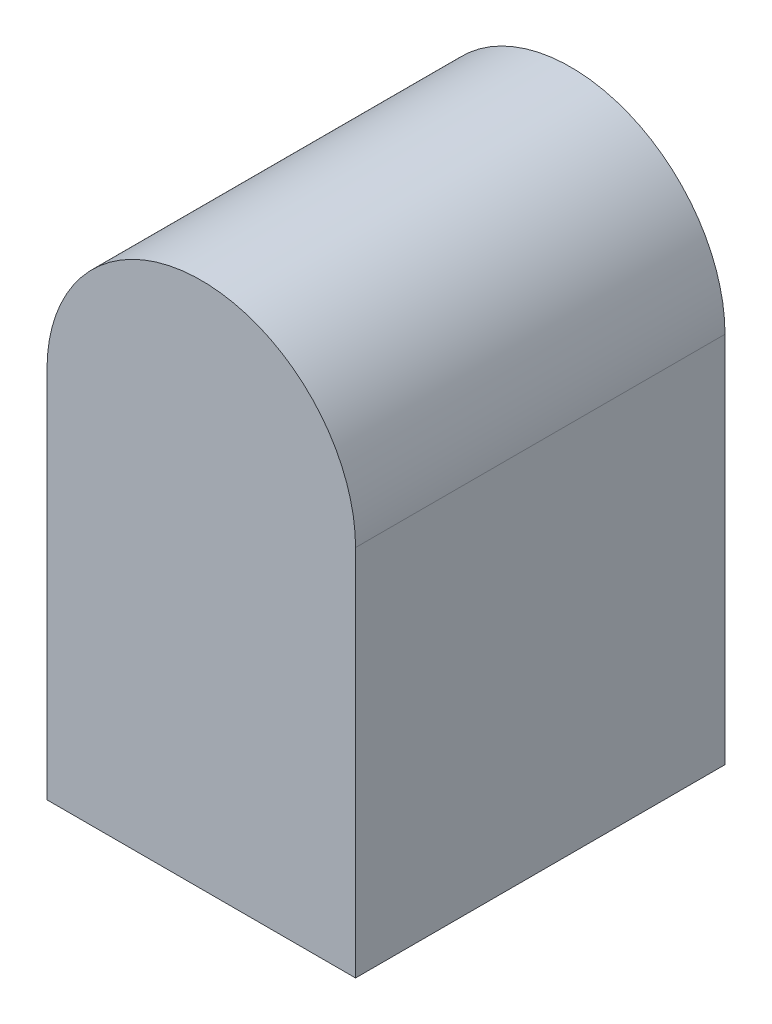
from build123d import *

# Parameters (mm, degrees)
SKETCH1_W      = 84.851796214
SKETCH1_H      = 144.942673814
EXTRUDE1_DEPTH = 50.8
FILLET1_RADIUS = 42.425898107
FILLET1_LENGTH = 101.6


with BuildPart() as part:
    # Sketch1 → Extrude1 (new, symmetric)
    with BuildSketch(Plane.XY):
        Rectangle(SKETCH1_W, SKETCH1_H)
    extrude(amount=EXTRUDE1_DEPTH, both=True)

    # Fillet1: full round fillet: the end face becomes a half cylinder, R = half its width
    fillet1_face = Plane((0, 72.471336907, 0), x_dir=(0, 0, 1), z_dir=(0, 1, 0))  # on the end face: x along it, z out of the body
    fillet1_slab = fillet1_face.offset(-FILLET1_RADIUS / 2) * Box(FILLET1_LENGTH, 2 * FILLET1_RADIUS, FILLET1_RADIUS, mode=Mode.PRIVATE)  # the body's end, R deep
    fillet1_round = Plane((0, 30.0454388, 0), x_dir=(0, 1, 0), z_dir=(0, 0, 1)) * Cylinder(FILLET1_RADIUS, FILLET1_LENGTH, mode=Mode.PRIVATE)  # its axis R under the face
    add(fillet1_slab - fillet1_round, mode=Mode.SUBTRACT)


solid = part.part
